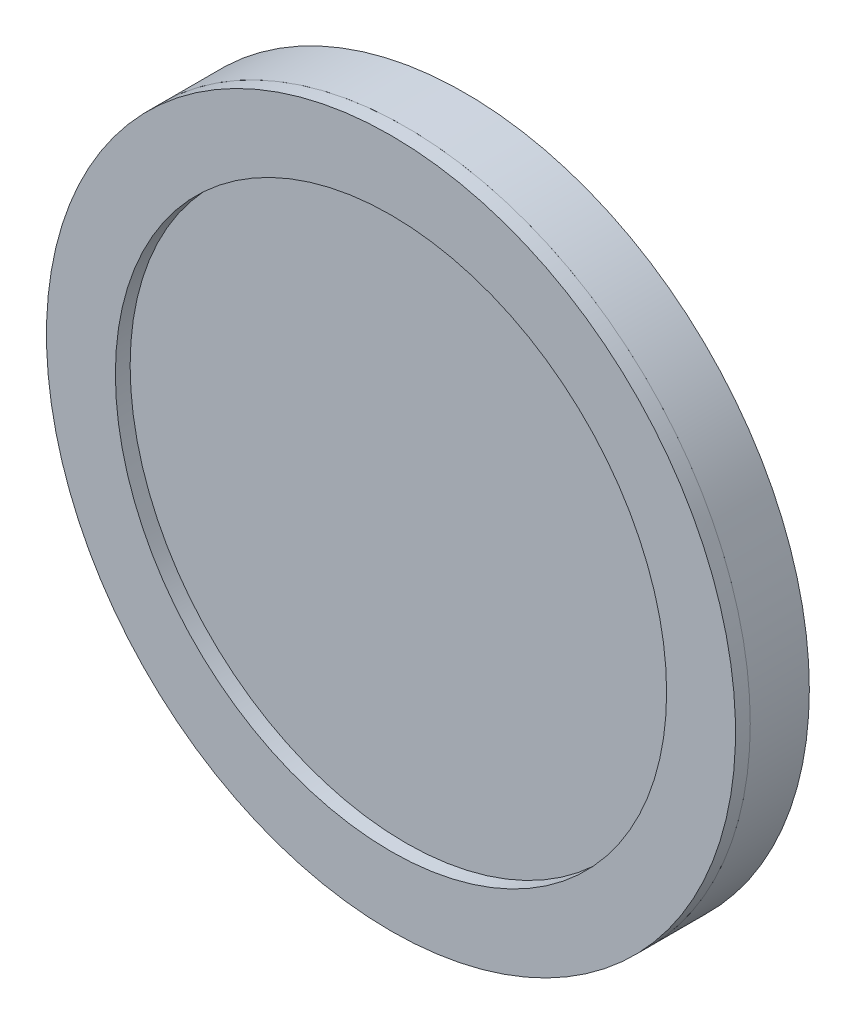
ISO-10303-21;
HEADER;
FILE_DESCRIPTION(('STEP AP214'),'2;1');
FILE_NAME('part.step','',(''),(''),'','','');
FILE_SCHEMA(('AUTOMOTIVE_DESIGN { 1 0 10303 214 1 1 1 1 }'));
ENDSEC;
DATA;
#1=APPLICATION_CONTEXT('core data for automotive mechanical design processes');
#2=APPLICATION_PROTOCOL_DEFINITION('international standard','automotive_design',2000,#1);
#3=PRODUCT_CONTEXT('',#1,'mechanical');
#4=PRODUCT('Part','Part','',(#3));
#5=PRODUCT_RELATED_PRODUCT_CATEGORY('part','',(#4));
#6=PRODUCT_DEFINITION_FORMATION('','',#4);
#7=PRODUCT_DEFINITION_CONTEXT('part definition',#1,'design');
#8=PRODUCT_DEFINITION('design','',#6,#7);
#9=PRODUCT_DEFINITION_SHAPE('','',#8);
#10=(LENGTH_UNIT() NAMED_UNIT(*) SI_UNIT(.MILLI.,.METRE.));
#11=(NAMED_UNIT(*) PLANE_ANGLE_UNIT() SI_UNIT($,.RADIAN.));
#12=(NAMED_UNIT(*) SI_UNIT($,.STERADIAN.) SOLID_ANGLE_UNIT());
#13=UNCERTAINTY_MEASURE_WITH_UNIT(LENGTH_MEASURE(1.E-05),#10,'distance_accuracy_value','');
#14=(GEOMETRIC_REPRESENTATION_CONTEXT(3) GLOBAL_UNCERTAINTY_ASSIGNED_CONTEXT((#13)) GLOBAL_UNIT_ASSIGNED_CONTEXT((#10,
#11,#12)) REPRESENTATION_CONTEXT('',''));
#15=CARTESIAN_POINT('',(0.,0.,0.));
#16=DIRECTION('',(0.,0.,1.));
#17=DIRECTION('',(1.,0.,0.));
#18=AXIS2_PLACEMENT_3D('',#15,#16,#17);
#19=CARTESIAN_POINT('',(-3.,52.,53.2474746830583));
#20=DIRECTION('',(0.,0.,-1.));
#21=DIRECTION('',(-1.,0.,0.));
#22=AXIS2_PLACEMENT_3D('',#19,#20,#21);
#23=CYLINDRICAL_SURFACE('',#22,17.5);
#24=CARTESIAN_POINT('',(-3.,52.,3.));
#25=DIRECTION('',(0.,0.,1.));
#26=DIRECTION('',(1.,0.,0.));
#27=AXIS2_PLACEMENT_3D('',#24,#25,#26);
#28=CIRCLE('',#27,17.5);
#29=CARTESIAN_POINT('',(14.5,52.,3.));
#30=VERTEX_POINT('',#29);
#31=EDGE_CURVE('E44',#30,#30,#28,.T.);
#32=ORIENTED_EDGE('',*,*,#31,.T.);
#33=EDGE_LOOP('',(#32));
#34=FACE_BOUND('',#33,.T.);
#35=CARTESIAN_POINT('',(-3.,52.,3.75000000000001));
#36=DIRECTION('',(0.,0.,1.));
#37=DIRECTION('',(0.,-1.,0.));
#38=AXIS2_PLACEMENT_3D('',#35,#36,#37);
#39=CIRCLE('',#38,17.5);
#40=CARTESIAN_POINT('',(-3.,34.5,3.75000000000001));
#41=VERTEX_POINT('',#40);
#42=EDGE_CURVE('E11',#41,#41,#39,.T.);
#43=ORIENTED_EDGE('',*,*,#42,.F.);
#44=EDGE_LOOP('',(#43));
#45=FACE_BOUND('',#44,.T.);
#46=ADVANCED_FACE('F37',(#34,#45),#23,.T.);
#47=CARTESIAN_POINT('',(-3.,52.,3.));
#48=DIRECTION('',(0.,0.,1.));
#49=DIRECTION('',(1.,0.,0.));
#50=AXIS2_PLACEMENT_3D('',#47,#48,#49);
#51=PLANE('',#50);
#52=ORIENTED_EDGE('',*,*,#31,.F.);
#53=EDGE_LOOP('',(#52));
#54=FACE_BOUND('',#53,.T.);
#55=CARTESIAN_POINT('',(-3.,52.,3.));
#56=DIRECTION('',(0.,0.,1.));
#57=DIRECTION('',(1.,0.,0.));
#58=AXIS2_PLACEMENT_3D('',#55,#56,#57);
#59=CIRCLE('',#58,14.);
#60=CARTESIAN_POINT('',(11.,52.,3.));
#61=VERTEX_POINT('',#60);
#62=EDGE_CURVE('E49',#61,#61,#59,.T.);
#63=ORIENTED_EDGE('',*,*,#62,.T.);
#64=EDGE_LOOP('',(#63));
#65=FACE_BOUND('',#64,.T.);
#66=ADVANCED_FACE('F65',(#54,#65),#51,.F.);
#67=CARTESIAN_POINT('',(-3.,52.,53.2474746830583));
#68=DIRECTION('',(0.,0.,-1.));
#69=DIRECTION('',(-1.,0.,0.));
#70=AXIS2_PLACEMENT_3D('',#67,#68,#69);
#71=CYLINDRICAL_SURFACE('',#70,14.);
#72=ORIENTED_EDGE('',*,*,#62,.F.);
#73=EDGE_LOOP('',(#72));
#74=FACE_BOUND('',#73,.T.);
#75=CARTESIAN_POINT('',(-3.,52.,3.75000000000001));
#76=DIRECTION('',(0.,0.,1.));
#77=DIRECTION('',(0.,-1.,0.));
#78=AXIS2_PLACEMENT_3D('',#75,#76,#77);
#79=CIRCLE('',#78,14.);
#80=CARTESIAN_POINT('',(-3.,38.,3.75000000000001));
#81=VERTEX_POINT('',#80);
#82=EDGE_CURVE('E40',#81,#81,#79,.T.);
#83=ORIENTED_EDGE('',*,*,#82,.T.);
#84=EDGE_LOOP('',(#83));
#85=FACE_BOUND('',#84,.T.);
#86=ADVANCED_FACE('F57',(#74,#85),#71,.F.);
#87=CARTESIAN_POINT('',(-9.32030863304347,36.7584876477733,3.75000000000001));
#88=DIRECTION('',(0.,0.,1.));
#89=DIRECTION('',(-0.38304900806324,-0.923728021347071,0.));
#90=AXIS2_PLACEMENT_3D('',#87,#88,#89);
#91=PLANE('',#90);
#92=ORIENTED_EDGE('',*,*,#82,.F.);
#93=EDGE_LOOP('',(#92));
#94=FACE_BOUND('',#93,.T.);
#95=ORIENTED_EDGE('',*,*,#42,.T.);
#96=EDGE_LOOP('',(#95));
#97=FACE_BOUND('',#96,.T.);
#98=ADVANCED_FACE('F59',(#94,#97),#91,.T.);
#99=CLOSED_SHELL('',(#46,#66,#86,#98));
#100=MANIFOLD_SOLID_BREP('B2',#99);
#101=CARTESIAN_POINT('',(-3.,52.,3.));
#102=DIRECTION('',(0.,0.,-1.));
#103=DIRECTION('',(-1.,0.,0.));
#104=AXIS2_PLACEMENT_3D('',#101,#102,#103);
#105=CYLINDRICAL_SURFACE('',#104,17.5);
#106=CARTESIAN_POINT('',(-3.,52.,3.));
#107=DIRECTION('',(0.,0.,1.));
#108=DIRECTION('',(1.,0.,0.));
#109=AXIS2_PLACEMENT_3D('',#106,#107,#108);
#110=CIRCLE('',#109,17.5);
#111=CARTESIAN_POINT('',(14.5,52.,3.));
#112=VERTEX_POINT('',#111);
#113=EDGE_CURVE('E36',#112,#112,#110,.T.);
#114=ORIENTED_EDGE('',*,*,#113,.F.);
#115=EDGE_LOOP('',(#114));
#116=FACE_BOUND('',#115,.T.);
#117=CARTESIAN_POINT('',(-3.,52.,0.));
#118=DIRECTION('',(0.,0.,1.));
#119=DIRECTION('',(1.,0.,0.));
#120=AXIS2_PLACEMENT_3D('',#117,#118,#119);
#121=CIRCLE('',#120,17.5);
#122=CARTESIAN_POINT('',(14.5,52.,0.));
#123=VERTEX_POINT('',#122);
#124=EDGE_CURVE('E94',#123,#123,#121,.T.);
#125=ORIENTED_EDGE('',*,*,#124,.T.);
#126=EDGE_LOOP('',(#125));
#127=FACE_BOUND('',#126,.T.);
#128=ADVANCED_FACE('F91',(#116,#127),#105,.T.);
#129=CARTESIAN_POINT('',(-3.,52.,3.));
#130=DIRECTION('',(0.,0.,1.));
#131=DIRECTION('',(1.,0.,0.));
#132=AXIS2_PLACEMENT_3D('',#129,#130,#131);
#133=PLANE('',#132);
#134=ORIENTED_EDGE('',*,*,#113,.T.);
#135=EDGE_LOOP('',(#134));
#136=FACE_BOUND('',#135,.T.);
#137=ADVANCED_FACE('F106',(#136),#133,.T.);
#138=CARTESIAN_POINT('',(-3.,52.,0.));
#139=DIRECTION('',(0.,0.,1.));
#140=DIRECTION('',(1.,0.,0.));
#141=AXIS2_PLACEMENT_3D('',#138,#139,#140);
#142=PLANE('',#141);
#143=ORIENTED_EDGE('',*,*,#124,.F.);
#144=EDGE_LOOP('',(#143));
#145=FACE_BOUND('',#144,.T.);
#146=ADVANCED_FACE('F104',(#145),#142,.F.);
#147=CLOSED_SHELL('',(#128,#137,#146));
#148=MANIFOLD_SOLID_BREP('B6',#147);
#149=ADVANCED_BREP_SHAPE_REPRESENTATION('',(#18,#100,#148),#14);
#150=SHAPE_DEFINITION_REPRESENTATION(#9,#149);
ENDSEC;
END-ISO-10303-21;
